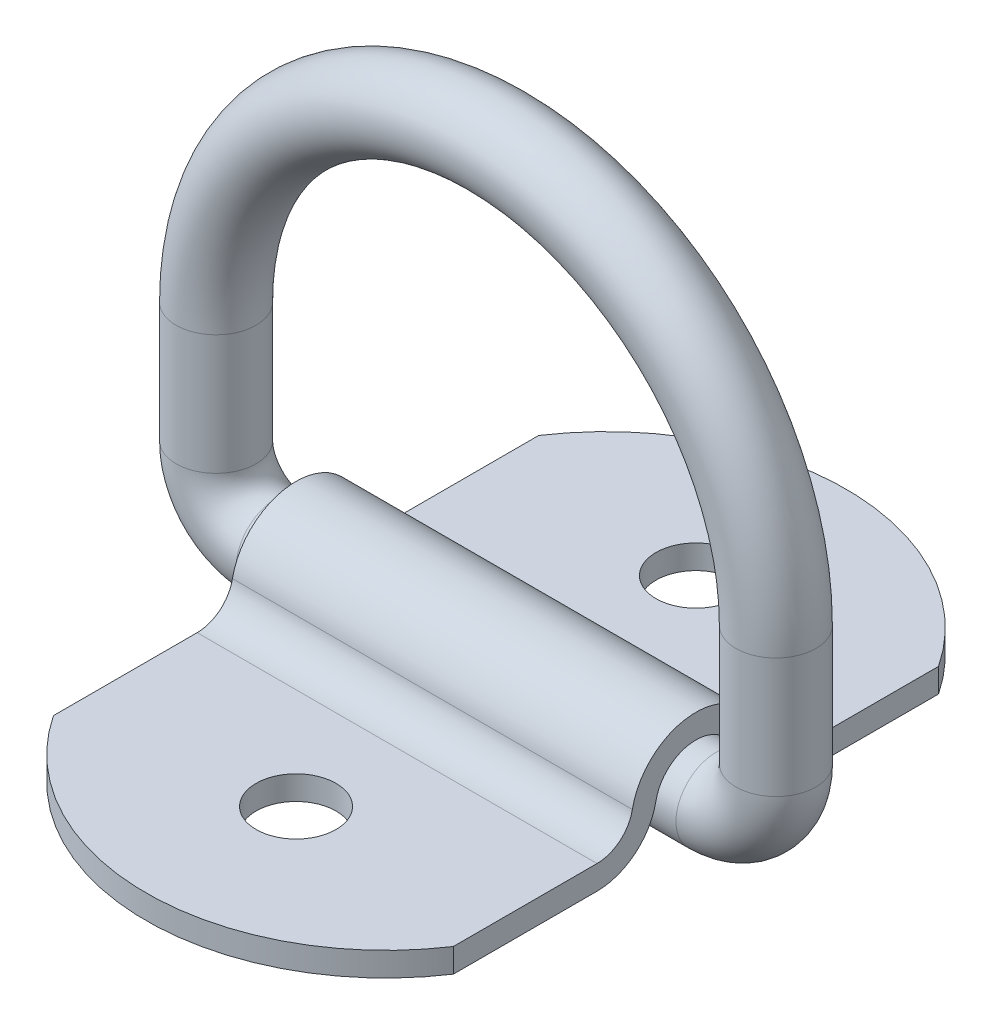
ISO-10303-21;
HEADER;
FILE_DESCRIPTION(('STEP AP214'),'2;1');
FILE_NAME('part.step','',(''),(''),'','','');
FILE_SCHEMA(('AUTOMOTIVE_DESIGN { 1 0 10303 214 1 1 1 1 }'));
ENDSEC;
DATA;
#1=APPLICATION_CONTEXT('core data for automotive mechanical design processes');
#2=APPLICATION_PROTOCOL_DEFINITION('international standard','automotive_design',2000,#1);
#3=PRODUCT_CONTEXT('',#1,'mechanical');
#4=PRODUCT('Part','Part','',(#3));
#5=PRODUCT_RELATED_PRODUCT_CATEGORY('part','',(#4));
#6=PRODUCT_DEFINITION_FORMATION('','',#4);
#7=PRODUCT_DEFINITION_CONTEXT('part definition',#1,'design');
#8=PRODUCT_DEFINITION('design','',#6,#7);
#9=PRODUCT_DEFINITION_SHAPE('','',#8);
#10=(LENGTH_UNIT() NAMED_UNIT(*) SI_UNIT(.MILLI.,.METRE.));
#11=(NAMED_UNIT(*) PLANE_ANGLE_UNIT() SI_UNIT($,.RADIAN.));
#12=(NAMED_UNIT(*) SI_UNIT($,.STERADIAN.) SOLID_ANGLE_UNIT());
#13=UNCERTAINTY_MEASURE_WITH_UNIT(LENGTH_MEASURE(1.E-05),#10,'distance_accuracy_value','');
#14=(GEOMETRIC_REPRESENTATION_CONTEXT(3) GLOBAL_UNCERTAINTY_ASSIGNED_CONTEXT((#13)) GLOBAL_UNIT_ASSIGNED_CONTEXT((#10,
#11,#12)) REPRESENTATION_CONTEXT('',''));
#15=CARTESIAN_POINT('',(0.,0.,0.));
#16=DIRECTION('',(0.,0.,1.));
#17=DIRECTION('',(1.,0.,0.));
#18=AXIS2_PLACEMENT_3D('',#15,#16,#17);
#19=CARTESIAN_POINT('',(15.875,-3.2385,27.78125));
#20=DIRECTION('',(0.,1.,0.));
#21=DIRECTION('',(0.,0.,1.));
#22=AXIS2_PLACEMENT_3D('',#19,#20,#21);
#23=PLANE('',#22);
#24=CARTESIAN_POINT('',(0.,-3.2385,15.875));
#25=DIRECTION('',(0.,-1.,0.));
#26=DIRECTION('',(0.,0.,-1.));
#27=AXIS2_PLACEMENT_3D('',#24,#25,#26);
#28=CIRCLE('',#27,3.175);
#29=CARTESIAN_POINT('',(0.,-3.2385,12.7));
#30=VERTEX_POINT('',#29);
#31=EDGE_CURVE('E211',#30,#30,#28,.T.);
#32=ORIENTED_EDGE('',*,*,#31,.F.);
#33=EDGE_LOOP('',(#32));
#34=FACE_BOUND('',#33,.T.);
#35=CARTESIAN_POINT('',(0.,-3.2385,8.73125));
#36=DIRECTION('',(0.,1.,0.));
#37=DIRECTION('',(0.,0.,-1.));
#38=AXIS2_PLACEMENT_3D('',#35,#36,#37);
#39=CIRCLE('',#38,19.05);
#40=CARTESIAN_POINT('',(-15.875,-3.2385,19.2615337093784));
#41=VERTEX_POINT('',#40);
#42=CARTESIAN_POINT('',(15.875,-3.2385,19.2615337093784));
#43=VERTEX_POINT('',#42);
#44=EDGE_CURVE('E210',#41,#43,#39,.T.);
#45=ORIENTED_EDGE('',*,*,#44,.F.);
#46=DIRECTION('',(0.,0.,-1.));
#47=VECTOR('',#46,1.);
#48=CARTESIAN_POINT('',(-15.875,-3.2385,27.78125));
#49=LINE('',#48,#47);
#50=CARTESIAN_POINT('',(-15.875,-3.2385,7.85451621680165));
#51=VERTEX_POINT('',#50);
#52=EDGE_CURVE('E164',#41,#51,#49,.T.);
#53=ORIENTED_EDGE('',*,*,#52,.T.);
#54=DIRECTION('',(-1.,0.,0.));
#55=VECTOR('',#54,1.);
#56=CARTESIAN_POINT('',(15.875,-3.2385,7.85451621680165));
#57=LINE('',#56,#55);
#58=CARTESIAN_POINT('',(15.875,-3.2385,7.85451621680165));
#59=VERTEX_POINT('',#58);
#60=EDGE_CURVE('E204',#59,#51,#57,.T.);
#61=ORIENTED_EDGE('',*,*,#60,.F.);
#62=DIRECTION('',(0.,0.,-1.));
#63=VECTOR('',#62,1.);
#64=CARTESIAN_POINT('',(15.875,-3.2385,27.78125));
#65=LINE('',#64,#63);
#66=EDGE_CURVE('E184',#43,#59,#65,.T.);
#67=ORIENTED_EDGE('',*,*,#66,.F.);
#68=EDGE_LOOP('',(#45,#53,#61,#67));
#69=FACE_BOUND('',#68,.T.);
#70=ADVANCED_FACE('F40',(#34,#69),#23,.F.);
#71=CARTESIAN_POINT('',(15.875,1.524,7.85451621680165));
#72=DIRECTION('',(-1.,0.,0.));
#73=DIRECTION('',(0.,0.,1.));
#74=AXIS2_PLACEMENT_3D('',#71,#72,#73);
#75=CYLINDRICAL_SURFACE('',#74,4.7625);
#76=CARTESIAN_POINT('',(-15.875,1.524,7.85451621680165));
#77=DIRECTION('',(1.,0.,0.));
#78=DIRECTION('',(0.,0.,-1.));
#79=AXIS2_PLACEMENT_3D('',#76,#77,#78);
#80=CIRCLE('',#79,4.7625);
#81=CARTESIAN_POINT('',(-15.875,0.616857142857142,3.1792089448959));
#82=VERTEX_POINT('',#81);
#83=EDGE_CURVE('E166',#51,#82,#80,.T.);
#84=ORIENTED_EDGE('',*,*,#83,.T.);
#85=DIRECTION('',(-1.,0.,0.));
#86=VECTOR('',#85,1.);
#87=CARTESIAN_POINT('',(15.875,0.616857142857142,3.1792089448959));
#88=LINE('',#87,#86);
#89=CARTESIAN_POINT('',(15.875,0.616857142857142,3.1792089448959));
#90=VERTEX_POINT('',#89);
#91=EDGE_CURVE('E201',#90,#82,#88,.T.);
#92=ORIENTED_EDGE('',*,*,#91,.F.);
#93=CARTESIAN_POINT('',(15.875,1.524,7.85451621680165));
#94=DIRECTION('',(1.,0.,0.));
#95=DIRECTION('',(0.,0.,-1.));
#96=AXIS2_PLACEMENT_3D('',#93,#94,#95);
#97=CIRCLE('',#96,4.7625);
#98=EDGE_CURVE('E231',#59,#90,#97,.T.);
#99=ORIENTED_EDGE('',*,*,#98,.F.);
#100=ORIENTED_EDGE('',*,*,#60,.T.);
#101=EDGE_LOOP('',(#84,#92,#99,#100));
#102=FACE_BOUND('',#101,.T.);
#103=ADVANCED_FACE('F274',(#102),#75,.T.);
#104=CARTESIAN_POINT('',(15.875,0.,0.));
#105=DIRECTION('',(-1.,0.,0.));
#106=DIRECTION('',(0.,0.,1.));
#107=AXIS2_PLACEMENT_3D('',#104,#105,#106);
#108=CYLINDRICAL_SURFACE('',#107,3.2385);
#109=CARTESIAN_POINT('',(-15.875,0.,0.));
#110=DIRECTION('',(-1.,0.,0.));
#111=DIRECTION('',(0.,0.,1.));
#112=AXIS2_PLACEMENT_3D('',#109,#110,#111);
#113=CIRCLE('',#112,3.2385);
#114=CARTESIAN_POINT('',(-15.875,0.61685714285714,-3.17920894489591));
#115=VERTEX_POINT('',#114);
#116=EDGE_CURVE('E168',#82,#115,#113,.T.);
#117=ORIENTED_EDGE('',*,*,#116,.T.);
#118=DIRECTION('',(-1.,0.,0.));
#119=VECTOR('',#118,1.);
#120=CARTESIAN_POINT('',(15.875,0.61685714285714,-3.17920894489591));
#121=LINE('',#120,#119);
#122=CARTESIAN_POINT('',(15.875,0.61685714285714,-3.17920894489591));
#123=VERTEX_POINT('',#122);
#124=EDGE_CURVE('E198',#123,#115,#121,.T.);
#125=ORIENTED_EDGE('',*,*,#124,.F.);
#126=CARTESIAN_POINT('',(15.875,0.,0.));
#127=DIRECTION('',(-1.,0.,0.));
#128=DIRECTION('',(0.,0.,1.));
#129=AXIS2_PLACEMENT_3D('',#126,#127,#128);
#130=CIRCLE('',#129,3.2385);
#131=EDGE_CURVE('E151',#90,#123,#130,.T.);
#132=ORIENTED_EDGE('',*,*,#131,.F.);
#133=ORIENTED_EDGE('',*,*,#91,.T.);
#134=EDGE_LOOP('',(#117,#125,#132,#133));
#135=FACE_BOUND('',#134,.T.);
#136=ADVANCED_FACE('F237',(#135),#108,.F.);
#137=CARTESIAN_POINT('',(15.875,1.524,-7.85451621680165));
#138=DIRECTION('',(-1.,0.,0.));
#139=DIRECTION('',(0.,0.,1.));
#140=AXIS2_PLACEMENT_3D('',#137,#138,#139);
#141=CYLINDRICAL_SURFACE('',#140,4.7625);
#142=CARTESIAN_POINT('',(-15.875,1.524,-7.85451621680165));
#143=DIRECTION('',(1.,0.,0.));
#144=DIRECTION('',(0.,0.,1.));
#145=AXIS2_PLACEMENT_3D('',#142,#143,#144);
#146=CIRCLE('',#145,4.7625);
#147=CARTESIAN_POINT('',(-15.875,-3.2385,-7.85451621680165));
#148=VERTEX_POINT('',#147);
#149=EDGE_CURVE('E170',#115,#148,#146,.T.);
#150=ORIENTED_EDGE('',*,*,#149,.T.);
#151=DIRECTION('',(-1.,0.,0.));
#152=VECTOR('',#151,1.);
#153=CARTESIAN_POINT('',(15.875,-3.2385,-7.85451621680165));
#154=LINE('',#153,#152);
#155=CARTESIAN_POINT('',(15.875,-3.2385,-7.85451621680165));
#156=VERTEX_POINT('',#155);
#157=EDGE_CURVE('E196',#156,#148,#154,.T.);
#158=ORIENTED_EDGE('',*,*,#157,.F.);
#159=CARTESIAN_POINT('',(15.875,1.524,-7.85451621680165));
#160=DIRECTION('',(1.,0.,0.));
#161=DIRECTION('',(0.,0.,1.));
#162=AXIS2_PLACEMENT_3D('',#159,#160,#161);
#163=CIRCLE('',#162,4.7625);
#164=EDGE_CURVE('E145',#123,#156,#163,.T.);
#165=ORIENTED_EDGE('',*,*,#164,.F.);
#166=ORIENTED_EDGE('',*,*,#124,.T.);
#167=EDGE_LOOP('',(#150,#158,#165,#166));
#168=FACE_BOUND('',#167,.T.);
#169=ADVANCED_FACE('F241',(#168),#141,.T.);
#170=CARTESIAN_POINT('',(15.875,-3.23849999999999,-27.78125));
#171=DIRECTION('',(0.,1.,0.));
#172=DIRECTION('',(0.,0.,1.));
#173=AXIS2_PLACEMENT_3D('',#170,#171,#172);
#174=PLANE('',#173);
#175=CARTESIAN_POINT('',(0.,-3.2385,-15.875));
#176=DIRECTION('',(0.,-1.,0.));
#177=DIRECTION('',(0.,0.,1.));
#178=AXIS2_PLACEMENT_3D('',#175,#176,#177);
#179=CIRCLE('',#178,3.175);
#180=CARTESIAN_POINT('',(0.,-3.2385,-12.7));
#181=VERTEX_POINT('',#180);
#182=EDGE_CURVE('E214',#181,#181,#179,.T.);
#183=ORIENTED_EDGE('',*,*,#182,.F.);
#184=EDGE_LOOP('',(#183));
#185=FACE_BOUND('',#184,.T.);
#186=DIRECTION('',(0.,0.,-1.));
#187=VECTOR('',#186,1.);
#188=CARTESIAN_POINT('',(-15.875,-3.23849999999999,-27.78125));
#189=LINE('',#188,#187);
#190=CARTESIAN_POINT('',(-15.875,-3.23849999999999,-19.2615337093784));
#191=VERTEX_POINT('',#190);
#192=EDGE_CURVE('E141',#148,#191,#189,.T.);
#193=ORIENTED_EDGE('',*,*,#192,.T.);
#194=CARTESIAN_POINT('',(0.,-3.2385,-8.73125));
#195=DIRECTION('',(0.,1.,0.));
#196=DIRECTION('',(0.,0.,1.));
#197=AXIS2_PLACEMENT_3D('',#194,#195,#196);
#198=CIRCLE('',#197,19.05);
#199=CARTESIAN_POINT('',(15.875,-3.2385,-19.2615337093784));
#200=VERTEX_POINT('',#199);
#201=EDGE_CURVE('E54',#200,#191,#198,.T.);
#202=ORIENTED_EDGE('',*,*,#201,.F.);
#203=DIRECTION('',(0.,0.,-1.));
#204=VECTOR('',#203,1.);
#205=CARTESIAN_POINT('',(15.875,-3.23849999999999,-27.78125));
#206=LINE('',#205,#204);
#207=EDGE_CURVE('E139',#156,#200,#206,.T.);
#208=ORIENTED_EDGE('',*,*,#207,.F.);
#209=ORIENTED_EDGE('',*,*,#157,.T.);
#210=EDGE_LOOP('',(#193,#202,#208,#209));
#211=FACE_BOUND('',#210,.T.);
#212=ADVANCED_FACE('F137',(#185,#211),#174,.F.);
#213=CARTESIAN_POINT('',(15.875,-1.33349999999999,-27.78125));
#214=DIRECTION('',(0.,-1.,0.));
#215=DIRECTION('',(0.,0.,-1.));
#216=AXIS2_PLACEMENT_3D('',#213,#214,#215);
#217=PLANE('',#216);
#218=CARTESIAN_POINT('',(0.,-1.33349999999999,-15.875));
#219=DIRECTION('',(0.,-1.,0.));
#220=DIRECTION('',(0.,0.,-1.));
#221=AXIS2_PLACEMENT_3D('',#218,#219,#220);
#222=CIRCLE('',#221,3.175);
#223=CARTESIAN_POINT('',(0.,-1.33349999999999,-19.05));
#224=VERTEX_POINT('',#223);
#225=EDGE_CURVE('E212',#224,#224,#222,.T.);
#226=ORIENTED_EDGE('',*,*,#225,.T.);
#227=EDGE_LOOP('',(#226));
#228=FACE_BOUND('',#227,.T.);
#229=DIRECTION('',(0.,0.,1.));
#230=VECTOR('',#229,1.);
#231=CARTESIAN_POINT('',(15.875,-1.33349999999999,-27.78125));
#232=LINE('',#231,#230);
#233=CARTESIAN_POINT('',(15.875,-1.33349999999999,-19.2615337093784));
#234=VERTEX_POINT('',#233);
#235=CARTESIAN_POINT('',(15.875,-1.3335,-7.85451621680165));
#236=VERTEX_POINT('',#235);
#237=EDGE_CURVE('E147',#234,#236,#232,.T.);
#238=ORIENTED_EDGE('',*,*,#237,.F.);
#239=CARTESIAN_POINT('',(0.,-1.3335,-8.73125));
#240=DIRECTION('',(0.,-1.,0.));
#241=DIRECTION('',(0.,0.,-1.));
#242=AXIS2_PLACEMENT_3D('',#239,#240,#241);
#243=CIRCLE('',#242,19.05);
#244=CARTESIAN_POINT('',(-15.875,-1.33349999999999,-19.2615337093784));
#245=VERTEX_POINT('',#244);
#246=EDGE_CURVE('E129',#234,#245,#243,.F.);
#247=ORIENTED_EDGE('',*,*,#246,.T.);
#248=DIRECTION('',(0.,0.,1.));
#249=VECTOR('',#248,1.);
#250=CARTESIAN_POINT('',(-15.875,-1.33349999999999,-27.78125));
#251=LINE('',#250,#249);
#252=CARTESIAN_POINT('',(-15.875,-1.3335,-7.85451621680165));
#253=VERTEX_POINT('',#252);
#254=EDGE_CURVE('E173',#245,#253,#251,.T.);
#255=ORIENTED_EDGE('',*,*,#254,.T.);
#256=DIRECTION('',(-1.,0.,0.));
#257=VECTOR('',#256,1.);
#258=CARTESIAN_POINT('',(15.875,-1.3335,-7.85451621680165));
#259=LINE('',#258,#257);
#260=EDGE_CURVE('E193',#236,#253,#259,.T.);
#261=ORIENTED_EDGE('',*,*,#260,.F.);
#262=EDGE_LOOP('',(#238,#247,#255,#261));
#263=FACE_BOUND('',#262,.T.);
#264=ADVANCED_FACE('F247',(#228,#263),#217,.F.);
#265=CARTESIAN_POINT('',(15.875,1.524,-7.85451621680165));
#266=DIRECTION('',(-1.,0.,0.));
#267=DIRECTION('',(0.,0.,1.));
#268=AXIS2_PLACEMENT_3D('',#265,#266,#267);
#269=CYLINDRICAL_SURFACE('',#268,2.8575);
#270=CARTESIAN_POINT('',(-15.875,1.524,-7.85451621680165));
#271=DIRECTION('',(-1.,0.,0.));
#272=DIRECTION('',(0.,0.,1.));
#273=AXIS2_PLACEMENT_3D('',#270,#271,#272);
#274=CIRCLE('',#273,2.8575);
#275=CARTESIAN_POINT('',(-15.875,0.979714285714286,-5.0493318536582));
#276=VERTEX_POINT('',#275);
#277=EDGE_CURVE('E175',#253,#276,#274,.T.);
#278=ORIENTED_EDGE('',*,*,#277,.T.);
#279=DIRECTION('',(-1.,0.,0.));
#280=VECTOR('',#279,1.);
#281=CARTESIAN_POINT('',(15.875,0.979714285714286,-5.0493318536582));
#282=LINE('',#281,#280);
#283=CARTESIAN_POINT('',(15.875,0.979714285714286,-5.0493318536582));
#284=VERTEX_POINT('',#283);
#285=EDGE_CURVE('E190',#284,#276,#282,.T.);
#286=ORIENTED_EDGE('',*,*,#285,.F.);
#287=CARTESIAN_POINT('',(15.875,1.524,-7.85451621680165));
#288=DIRECTION('',(-1.,0.,0.));
#289=DIRECTION('',(0.,0.,1.));
#290=AXIS2_PLACEMENT_3D('',#287,#288,#289);
#291=CIRCLE('',#290,2.8575);
#292=EDGE_CURVE('E149',#236,#284,#291,.T.);
#293=ORIENTED_EDGE('',*,*,#292,.F.);
#294=ORIENTED_EDGE('',*,*,#260,.T.);
#295=EDGE_LOOP('',(#278,#286,#293,#294));
#296=FACE_BOUND('',#295,.T.);
#297=ADVANCED_FACE('F254',(#296),#269,.F.);
#298=CARTESIAN_POINT('',(15.875,0.,0.));
#299=DIRECTION('',(-1.,0.,0.));
#300=DIRECTION('',(0.,0.,1.));
#301=AXIS2_PLACEMENT_3D('',#298,#299,#300);
#302=CYLINDRICAL_SURFACE('',#301,5.1435);
#303=CARTESIAN_POINT('',(-15.875,0.,0.));
#304=DIRECTION('',(1.,0.,0.));
#305=DIRECTION('',(0.,0.,1.));
#306=AXIS2_PLACEMENT_3D('',#303,#304,#305);
#307=CIRCLE('',#306,5.1435);
#308=CARTESIAN_POINT('',(-15.875,0.979714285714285,5.0493318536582));
#309=VERTEX_POINT('',#308);
#310=EDGE_CURVE('E177',#276,#309,#307,.T.);
#311=ORIENTED_EDGE('',*,*,#310,.T.);
#312=DIRECTION('',(-1.,0.,0.));
#313=VECTOR('',#312,1.);
#314=CARTESIAN_POINT('',(15.875,0.979714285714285,5.0493318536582));
#315=LINE('',#314,#313);
#316=CARTESIAN_POINT('',(15.875,0.979714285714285,5.0493318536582));
#317=VERTEX_POINT('',#316);
#318=EDGE_CURVE('E187',#317,#309,#315,.T.);
#319=ORIENTED_EDGE('',*,*,#318,.F.);
#320=CARTESIAN_POINT('',(15.875,0.,0.));
#321=DIRECTION('',(1.,0.,0.));
#322=DIRECTION('',(0.,0.,1.));
#323=AXIS2_PLACEMENT_3D('',#320,#321,#322);
#324=CIRCLE('',#323,5.1435);
#325=EDGE_CURVE('E156',#284,#317,#324,.T.);
#326=ORIENTED_EDGE('',*,*,#325,.F.);
#327=ORIENTED_EDGE('',*,*,#285,.T.);
#328=EDGE_LOOP('',(#311,#319,#326,#327));
#329=FACE_BOUND('',#328,.T.);
#330=ADVANCED_FACE('F257',(#329),#302,.T.);
#331=CARTESIAN_POINT('',(15.875,1.524,7.85451621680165));
#332=DIRECTION('',(-1.,0.,0.));
#333=DIRECTION('',(0.,0.,1.));
#334=AXIS2_PLACEMENT_3D('',#331,#332,#333);
#335=CYLINDRICAL_SURFACE('',#334,2.8575);
#336=CARTESIAN_POINT('',(-15.875,1.524,7.85451621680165));
#337=DIRECTION('',(-1.,0.,0.));
#338=DIRECTION('',(0.,0.,-1.));
#339=AXIS2_PLACEMENT_3D('',#336,#337,#338);
#340=CIRCLE('',#339,2.8575);
#341=CARTESIAN_POINT('',(-15.875,-1.3335,7.85451621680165));
#342=VERTEX_POINT('',#341);
#343=EDGE_CURVE('E179',#309,#342,#340,.T.);
#344=ORIENTED_EDGE('',*,*,#343,.T.);
#345=DIRECTION('',(-1.,0.,0.));
#346=VECTOR('',#345,1.);
#347=CARTESIAN_POINT('',(15.875,-1.3335,7.85451621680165));
#348=LINE('',#347,#346);
#349=CARTESIAN_POINT('',(15.875,-1.3335,7.85451621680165));
#350=VERTEX_POINT('',#349);
#351=EDGE_CURVE('E163',#350,#342,#348,.T.);
#352=ORIENTED_EDGE('',*,*,#351,.F.);
#353=CARTESIAN_POINT('',(15.875,1.524,7.85451621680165));
#354=DIRECTION('',(-1.,0.,0.));
#355=DIRECTION('',(0.,0.,-1.));
#356=AXIS2_PLACEMENT_3D('',#353,#354,#355);
#357=CIRCLE('',#356,2.8575);
#358=EDGE_CURVE('E158',#317,#350,#357,.T.);
#359=ORIENTED_EDGE('',*,*,#358,.F.);
#360=ORIENTED_EDGE('',*,*,#318,.T.);
#361=EDGE_LOOP('',(#344,#352,#359,#360));
#362=FACE_BOUND('',#361,.T.);
#363=ADVANCED_FACE('F262',(#362),#335,.F.);
#364=CARTESIAN_POINT('',(15.875,-1.3335,27.78125));
#365=DIRECTION('',(0.,-1.,0.));
#366=DIRECTION('',(0.,0.,-1.));
#367=AXIS2_PLACEMENT_3D('',#364,#365,#366);
#368=PLANE('',#367);
#369=CARTESIAN_POINT('',(0.,-1.3335,15.875));
#370=DIRECTION('',(0.,-1.,0.));
#371=DIRECTION('',(0.,0.,-1.));
#372=AXIS2_PLACEMENT_3D('',#369,#370,#371);
#373=CIRCLE('',#372,3.175);
#374=CARTESIAN_POINT('',(0.,-1.3335,12.7));
#375=VERTEX_POINT('',#374);
#376=EDGE_CURVE('E208',#375,#375,#373,.T.);
#377=ORIENTED_EDGE('',*,*,#376,.T.);
#378=EDGE_LOOP('',(#377));
#379=FACE_BOUND('',#378,.T.);
#380=DIRECTION('',(0.,0.,1.));
#381=VECTOR('',#380,1.);
#382=CARTESIAN_POINT('',(-15.875,-1.3335,27.78125));
#383=LINE('',#382,#381);
#384=CARTESIAN_POINT('',(-15.875,-1.3335,19.2615337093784));
#385=VERTEX_POINT('',#384);
#386=EDGE_CURVE('E181',#342,#385,#383,.T.);
#387=ORIENTED_EDGE('',*,*,#386,.T.);
#388=CARTESIAN_POINT('',(0.,-1.3335,8.73125));
#389=DIRECTION('',(0.,-1.,0.));
#390=DIRECTION('',(0.,0.,-1.));
#391=AXIS2_PLACEMENT_3D('',#388,#389,#390);
#392=CIRCLE('',#391,19.05);
#393=CARTESIAN_POINT('',(15.875,-1.3335,19.2615337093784));
#394=VERTEX_POINT('',#393);
#395=EDGE_CURVE('E61',#385,#394,#392,.F.);
#396=ORIENTED_EDGE('',*,*,#395,.T.);
#397=DIRECTION('',(0.,0.,1.));
#398=VECTOR('',#397,1.);
#399=CARTESIAN_POINT('',(15.875,-1.3335,27.78125));
#400=LINE('',#399,#398);
#401=EDGE_CURVE('E160',#350,#394,#400,.T.);
#402=ORIENTED_EDGE('',*,*,#401,.F.);
#403=ORIENTED_EDGE('',*,*,#351,.T.);
#404=EDGE_LOOP('',(#387,#396,#402,#403));
#405=FACE_BOUND('',#404,.T.);
#406=ADVANCED_FACE('F266',(#379,#405),#368,.F.);
#407=CARTESIAN_POINT('',(15.875,1.524,7.85451621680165));
#408=DIRECTION('',(1.,0.,0.));
#409=DIRECTION('',(0.,0.,-1.));
#410=AXIS2_PLACEMENT_3D('',#407,#408,#409);
#411=PLANE('',#410);
#412=DIRECTION('',(0.,-1.,0.));
#413=VECTOR('',#412,1.);
#414=CARTESIAN_POINT('',(15.875,39.6874999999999,-19.2615337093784));
#415=LINE('',#414,#413);
#416=EDGE_CURVE('E126',#234,#200,#415,.T.);
#417=ORIENTED_EDGE('',*,*,#416,.F.);
#418=ORIENTED_EDGE('',*,*,#237,.T.);
#419=ORIENTED_EDGE('',*,*,#292,.T.);
#420=ORIENTED_EDGE('',*,*,#325,.T.);
#421=ORIENTED_EDGE('',*,*,#358,.T.);
#422=ORIENTED_EDGE('',*,*,#401,.T.);
#423=DIRECTION('',(0.,-1.,0.));
#424=VECTOR('',#423,1.);
#425=CARTESIAN_POINT('',(15.875,39.6874999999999,19.2615337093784));
#426=LINE('',#425,#424);
#427=EDGE_CURVE('E226',#394,#43,#426,.T.);
#428=ORIENTED_EDGE('',*,*,#427,.T.);
#429=ORIENTED_EDGE('',*,*,#66,.T.);
#430=ORIENTED_EDGE('',*,*,#98,.T.);
#431=ORIENTED_EDGE('',*,*,#131,.T.);
#432=ORIENTED_EDGE('',*,*,#164,.T.);
#433=ORIENTED_EDGE('',*,*,#207,.T.);
#434=EDGE_LOOP('',(#417,#418,#419,#420,#421,#422,#428,#429,#430,#431,#432,#433));
#435=FACE_BOUND('',#434,.T.);
#436=ADVANCED_FACE('F143',(#435),#411,.T.);
#437=CARTESIAN_POINT('',(-15.875,1.524,7.85451621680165));
#438=DIRECTION('',(1.,0.,0.));
#439=DIRECTION('',(0.,0.,-1.));
#440=AXIS2_PLACEMENT_3D('',#437,#438,#439);
#441=PLANE('',#440);
#442=ORIENTED_EDGE('',*,*,#254,.F.);
#443=DIRECTION('',(0.,-1.,0.));
#444=VECTOR('',#443,1.);
#445=CARTESIAN_POINT('',(-15.875,39.6874999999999,-19.2615337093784));
#446=LINE('',#445,#444);
#447=EDGE_CURVE('E12',#245,#191,#446,.T.);
#448=ORIENTED_EDGE('',*,*,#447,.T.);
#449=ORIENTED_EDGE('',*,*,#192,.F.);
#450=ORIENTED_EDGE('',*,*,#149,.F.);
#451=ORIENTED_EDGE('',*,*,#116,.F.);
#452=ORIENTED_EDGE('',*,*,#83,.F.);
#453=ORIENTED_EDGE('',*,*,#52,.F.);
#454=DIRECTION('',(0.,-1.,0.));
#455=VECTOR('',#454,1.);
#456=CARTESIAN_POINT('',(-15.875,39.6874999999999,19.2615337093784));
#457=LINE('',#456,#455);
#458=EDGE_CURVE('E47',#41,#385,#457,.F.);
#459=ORIENTED_EDGE('',*,*,#458,.T.);
#460=ORIENTED_EDGE('',*,*,#386,.F.);
#461=ORIENTED_EDGE('',*,*,#343,.F.);
#462=ORIENTED_EDGE('',*,*,#310,.F.);
#463=ORIENTED_EDGE('',*,*,#277,.F.);
#464=EDGE_LOOP('',(#442,#448,#449,#450,#451,#452,#453,#459,#460,#461,#462,#463));
#465=FACE_BOUND('',#464,.T.);
#466=ADVANCED_FACE('F244',(#465),#441,.F.);
#467=CARTESIAN_POINT('',(0.,39.6874999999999,8.73125));
#468=DIRECTION('',(0.,-1.,0.));
#469=DIRECTION('',(0.,0.,-1.));
#470=AXIS2_PLACEMENT_3D('',#467,#468,#469);
#471=CYLINDRICAL_SURFACE('',#470,19.05);
#472=ORIENTED_EDGE('',*,*,#458,.F.);
#473=ORIENTED_EDGE('',*,*,#44,.T.);
#474=ORIENTED_EDGE('',*,*,#427,.F.);
#475=ORIENTED_EDGE('',*,*,#395,.F.);
#476=EDGE_LOOP('',(#472,#473,#474,#475));
#477=FACE_BOUND('',#476,.T.);
#478=ADVANCED_FACE('F268',(#477),#471,.T.);
#479=CARTESIAN_POINT('',(0.,39.6874999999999,15.875));
#480=DIRECTION('',(0.,-1.,0.));
#481=DIRECTION('',(0.,0.,-1.));
#482=AXIS2_PLACEMENT_3D('',#479,#480,#481);
#483=CYLINDRICAL_SURFACE('',#482,3.175);
#484=ORIENTED_EDGE('',*,*,#31,.T.);
#485=EDGE_LOOP('',(#484));
#486=FACE_BOUND('',#485,.T.);
#487=ORIENTED_EDGE('',*,*,#376,.F.);
#488=EDGE_LOOP('',(#487));
#489=FACE_BOUND('',#488,.T.);
#490=ADVANCED_FACE('F305',(#486,#489),#483,.F.);
#491=CARTESIAN_POINT('',(0.,39.6874999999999,-15.875));
#492=DIRECTION('',(0.,-1.,0.));
#493=DIRECTION('',(0.,0.,-1.));
#494=AXIS2_PLACEMENT_3D('',#491,#492,#493);
#495=CYLINDRICAL_SURFACE('',#494,3.175);
#496=ORIENTED_EDGE('',*,*,#182,.T.);
#497=EDGE_LOOP('',(#496));
#498=FACE_BOUND('',#497,.T.);
#499=ORIENTED_EDGE('',*,*,#225,.F.);
#500=EDGE_LOOP('',(#499));
#501=FACE_BOUND('',#500,.T.);
#502=ADVANCED_FACE('F308',(#498,#501),#495,.F.);
#503=CARTESIAN_POINT('',(0.,39.6874999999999,-8.73124999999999));
#504=DIRECTION('',(0.,-1.,0.));
#505=DIRECTION('',(0.,0.,-1.));
#506=AXIS2_PLACEMENT_3D('',#503,#504,#505);
#507=CYLINDRICAL_SURFACE('',#506,19.05);
#508=ORIENTED_EDGE('',*,*,#201,.T.);
#509=ORIENTED_EDGE('',*,*,#447,.F.);
#510=ORIENTED_EDGE('',*,*,#246,.F.);
#511=ORIENTED_EDGE('',*,*,#416,.T.);
#512=EDGE_LOOP('',(#508,#509,#510,#511));
#513=FACE_BOUND('',#512,.T.);
#514=ADVANCED_FACE('F127',(#513),#507,.T.);
#515=CLOSED_SHELL('',(#70,#103,#136,#169,#212,#264,#297,#330,#363,#406,#436,#466,#478,#490,#502,#514));
#516=MANIFOLD_SOLID_BREP('B2',#515);
#517=CARTESIAN_POINT('',(17.4625,4.7625,0.));
#518=DIRECTION('',(0.,0.,-1.));
#519=DIRECTION('',(-1.,0.,0.));
#520=AXIS2_PLACEMENT_3D('',#517,#518,#519);
#521=TOROIDAL_SURFACE('',#520,4.7625,3.175);
#522=CARTESIAN_POINT('',(22.225,4.7625,0.));
#523=DIRECTION('',(0.,1.,0.));
#524=DIRECTION('',(0.,0.,-1.));
#525=AXIS2_PLACEMENT_3D('',#522,#523,#524);
#526=CIRCLE('',#525,3.175);
#527=CARTESIAN_POINT('',(25.4,4.7625,0.));
#528=VERTEX_POINT('',#527);
#529=EDGE_CURVE('E419',#528,#528,#526,.T.);
#530=CARTESIAN_POINT('',(17.4625,0.,0.));
#531=DIRECTION('',(1.,0.,0.));
#532=DIRECTION('',(0.,0.,-1.));
#533=AXIS2_PLACEMENT_3D('',#530,#531,#532);
#534=CIRCLE('',#533,3.175);
#535=CARTESIAN_POINT('',(17.4625,-3.175,0.));
#536=VERTEX_POINT('',#535);
#537=EDGE_CURVE('E39',#536,#536,#534,.T.);
#538=CARTESIAN_POINT('',(17.4625,4.7625,0.));
#539=DIRECTION('',(0.,0.,-1.));
#540=DIRECTION('',(-1.,0.,0.));
#541=AXIS2_PLACEMENT_3D('',#538,#539,#540);
#542=CIRCLE('',#541,7.9375);
#543=EDGE_CURVE('',#528,#536,#542,.T.);
#544=ORIENTED_EDGE('',*,*,#529,.F.);
#545=ORIENTED_EDGE('',*,*,#537,.T.);
#546=ORIENTED_EDGE('',*,*,#543,.T.);
#547=ORIENTED_EDGE('',*,*,#543,.F.);
#548=EDGE_LOOP('',(#544,#546,#545,#547));
#549=FACE_BOUND('',#548,.T.);
#550=ADVANCED_FACE('F413',(#549),#521,.T.);
#551=CARTESIAN_POINT('',(22.225,14.2874999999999,0.));
#552=DIRECTION('',(0.,-1.,0.));
#553=DIRECTION('',(0.,0.,-1.));
#554=AXIS2_PLACEMENT_3D('',#551,#552,#553);
#555=CYLINDRICAL_SURFACE('',#554,3.175);
#556=CARTESIAN_POINT('',(22.225,14.2874999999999,0.));
#557=DIRECTION('',(0.,1.,0.));
#558=DIRECTION('',(0.,0.,-1.));
#559=AXIS2_PLACEMENT_3D('',#556,#557,#558);
#560=CIRCLE('',#559,3.175);
#561=CARTESIAN_POINT('',(25.4,14.2874999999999,0.));
#562=VERTEX_POINT('',#561);
#563=EDGE_CURVE('E423',#562,#562,#560,.T.);
#564=ORIENTED_EDGE('',*,*,#563,.F.);
#565=EDGE_LOOP('',(#564));
#566=FACE_BOUND('',#565,.T.);
#567=ORIENTED_EDGE('',*,*,#529,.T.);
#568=EDGE_LOOP('',(#567));
#569=FACE_BOUND('',#568,.T.);
#570=ADVANCED_FACE('F457',(#566,#569),#555,.T.);
#571=CARTESIAN_POINT('',(0.,14.2874999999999,0.));
#572=DIRECTION('',(0.,0.,-1.));
#573=DIRECTION('',(-1.,0.,0.));
#574=AXIS2_PLACEMENT_3D('',#571,#572,#573);
#575=TOROIDAL_SURFACE('',#574,22.225,3.175);
#576=CARTESIAN_POINT('',(-22.225,14.2875,0.));
#577=DIRECTION('',(0.,-1.,0.));
#578=DIRECTION('',(0.,0.,-1.));
#579=AXIS2_PLACEMENT_3D('',#576,#577,#578);
#580=CIRCLE('',#579,3.175);
#581=CARTESIAN_POINT('',(-25.4,14.2875,0.));
#582=VERTEX_POINT('',#581);
#583=EDGE_CURVE('E427',#582,#582,#580,.T.);
#584=CARTESIAN_POINT('',(0.,14.2874999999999,0.));
#585=DIRECTION('',(0.,0.,-1.));
#586=DIRECTION('',(-1.,0.,0.));
#587=AXIS2_PLACEMENT_3D('',#584,#585,#586);
#588=CIRCLE('',#587,25.4);
#589=EDGE_CURVE('',#582,#562,#588,.T.);
#590=ORIENTED_EDGE('',*,*,#583,.F.);
#591=ORIENTED_EDGE('',*,*,#563,.T.);
#592=ORIENTED_EDGE('',*,*,#589,.T.);
#593=ORIENTED_EDGE('',*,*,#589,.F.);
#594=EDGE_LOOP('',(#590,#592,#591,#593));
#595=FACE_BOUND('',#594,.T.);
#596=ADVANCED_FACE('F451',(#595),#575,.T.);
#597=CARTESIAN_POINT('',(-22.225,4.76250000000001,0.));
#598=DIRECTION('',(0.,1.,0.));
#599=DIRECTION('',(0.,0.,1.));
#600=AXIS2_PLACEMENT_3D('',#597,#598,#599);
#601=CYLINDRICAL_SURFACE('',#600,3.175);
#602=CARTESIAN_POINT('',(-22.225,4.76250000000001,0.));
#603=DIRECTION('',(0.,-1.,0.));
#604=DIRECTION('',(0.,0.,-1.));
#605=AXIS2_PLACEMENT_3D('',#602,#603,#604);
#606=CIRCLE('',#605,3.175);
#607=CARTESIAN_POINT('',(-25.4,4.76250000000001,0.));
#608=VERTEX_POINT('',#607);
#609=EDGE_CURVE('E432',#608,#608,#606,.T.);
#610=ORIENTED_EDGE('',*,*,#609,.F.);
#611=EDGE_LOOP('',(#610));
#612=FACE_BOUND('',#611,.T.);
#613=ORIENTED_EDGE('',*,*,#583,.T.);
#614=EDGE_LOOP('',(#613));
#615=FACE_BOUND('',#614,.T.);
#616=ADVANCED_FACE('F445',(#612,#615),#601,.T.);
#617=CARTESIAN_POINT('',(-17.4625,4.7625,0.));
#618=DIRECTION('',(0.,0.,-1.));
#619=DIRECTION('',(-1.,0.,0.));
#620=AXIS2_PLACEMENT_3D('',#617,#618,#619);
#621=TOROIDAL_SURFACE('',#620,4.7625,3.175);
#622=CARTESIAN_POINT('',(-17.4625,0.,0.));
#623=DIRECTION('',(1.,0.,0.));
#624=DIRECTION('',(0.,0.,-1.));
#625=AXIS2_PLACEMENT_3D('',#622,#623,#624);
#626=CIRCLE('',#625,3.175);
#627=CARTESIAN_POINT('',(-17.4625,-3.175,0.));
#628=VERTEX_POINT('',#627);
#629=EDGE_CURVE('E435',#628,#628,#626,.T.);
#630=CARTESIAN_POINT('',(-17.4625,4.7625,0.));
#631=DIRECTION('',(0.,0.,-1.));
#632=DIRECTION('',(-1.,0.,0.));
#633=AXIS2_PLACEMENT_3D('',#630,#631,#632);
#634=CIRCLE('',#633,7.9375);
#635=EDGE_CURVE('',#628,#608,#634,.T.);
#636=ORIENTED_EDGE('',*,*,#629,.F.);
#637=ORIENTED_EDGE('',*,*,#609,.T.);
#638=ORIENTED_EDGE('',*,*,#635,.T.);
#639=ORIENTED_EDGE('',*,*,#635,.F.);
#640=EDGE_LOOP('',(#636,#638,#637,#639));
#641=FACE_BOUND('',#640,.T.);
#642=ADVANCED_FACE('F442',(#641),#621,.T.);
#643=CARTESIAN_POINT('',(-17.4625,0.,0.));
#644=DIRECTION('',(1.,0.,0.));
#645=DIRECTION('',(0.,0.,-1.));
#646=AXIS2_PLACEMENT_3D('',#643,#644,#645);
#647=CYLINDRICAL_SURFACE('',#646,3.175);
#648=ORIENTED_EDGE('',*,*,#629,.T.);
#649=EDGE_LOOP('',(#648));
#650=FACE_BOUND('',#649,.T.);
#651=ORIENTED_EDGE('',*,*,#537,.F.);
#652=EDGE_LOOP('',(#651));
#653=FACE_BOUND('',#652,.T.);
#654=ADVANCED_FACE('F439',(#650,#653),#647,.T.);
#655=CLOSED_SHELL('',(#550,#570,#596,#616,#642,#654));
#656=MANIFOLD_SOLID_BREP('B6',#655);
#657=ADVANCED_BREP_SHAPE_REPRESENTATION('',(#18,#516,#656),#14);
#658=SHAPE_DEFINITION_REPRESENTATION(#9,#657);
ENDSEC;
END-ISO-10303-21;
